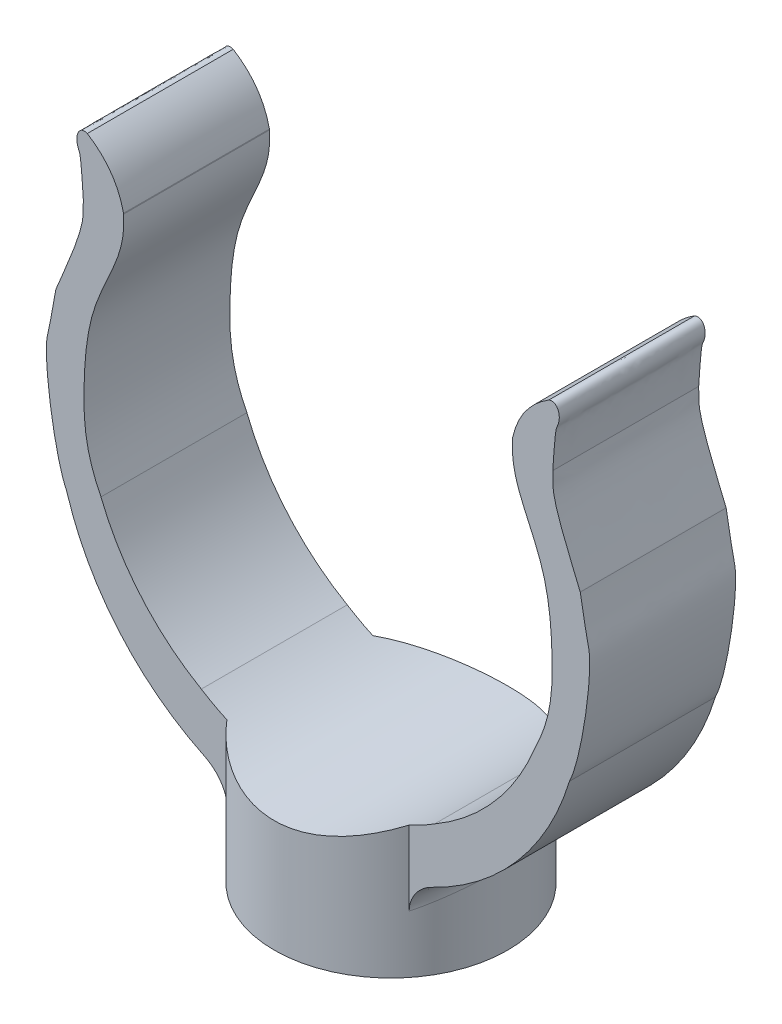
from build123d import *

# Parameters (mm, degrees)
BOSS_EXTRU_1_DEPTH      = 5
ESQUISSE2_W             = 8
ESQUISSE2_H             = 10
ENL_V_MAT_EXTRU_1_DEPTH = 10
CONG_2_R                = 2


with BuildPart() as part:
    # Esquisse1 → Boss.-Extru.1 (new, symmetric)
    with BuildSketch(Plane.XY):
        with BuildLine():
            Line((13.322060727, 27.670467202), (13.331601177, 27.719548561))
            add(Edge.make_bspline(
                [(13.331601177, 27.719548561), (13.827952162, 29.975991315), (15.815543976, 31.208467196)],
                knots=[0, 0, 0, 1, 1, 1], degree=2))
            add(Edge.make_bspline(
                [(16.088244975, 27.153165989), (16.091345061, 27.17556211), (16.227900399, 29.598287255), (16.44580055, 30.03221015), (16.667773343, 30.711579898), (16.276158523, 31.392474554), (15.815543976, 31.208467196)],
                knots=[0, 0, 0, 0, 0.319811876, 0.380234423, 0.604225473, 1, 1, 1, 1], degree=3))
            add(Edge.make_bspline(
                [(17.970441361, 20.884051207), (17.968154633, 20.898055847), (15.778116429, 26.01056167), (16.148061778, 26.238964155), (16.088244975, 27.153165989)],
                knots=[0.213455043, 0.213455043, 0.213455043, 0.213455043, 0.458677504, 1, 1, 1, 1], degree=3))
            add(Edge.make_bspline(
                [(17.970441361, 20.884051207), (18.289882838, 18.927691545), (18.536027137, 18.086463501), (18.769092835, 15.99102451), (18.004725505, 10.851542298), (17.225902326, 9.278095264)],
                knots=[0, 0, 0, 0, 0.210543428, 0.310543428, 1, 1, 1, 1], degree=3))
            ThreePointArc((17.225902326, 9.278095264), (0, -3.5), (-17.225902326, 9.278095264))
            add(Edge.make_bspline(
                [(-17.970441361, 20.884051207), (-18.289882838, 18.927691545), (-18.536027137, 18.086463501), (-18.769092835, 15.99102451), (-18.004725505, 10.851542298), (-17.225902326, 9.278095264)],
                knots=[0, 0, 0, 0, 0.210543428, 0.310543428, 1, 1, 1, 1], degree=3))
            add(Edge.make_bspline(
                [(-17.970441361, 20.884051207), (-17.968154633, 20.898055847), (-15.778116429, 26.01056167), (-16.148061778, 26.238964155), (-16.088244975, 27.153165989)],
                knots=[0.213455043, 0.213455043, 0.213455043, 0.213455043, 0.458677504, 1, 1, 1, 1], degree=3))
            add(Edge.make_bspline(
                [(-16.088244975, 27.153165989), (-16.091345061, 27.17556211), (-16.227900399, 29.598287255), (-16.44580055, 30.03221015), (-16.667773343, 30.711579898), (-16.276158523, 31.392474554), (-15.815543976, 31.208467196)],
                knots=[0, 0, 0, 0, 0.319811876, 0.380234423, 0.604225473, 1, 1, 1, 1], degree=3))
            add(Edge.make_bspline(
                [(-13.331601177, 27.719548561), (-13.827952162, 29.975991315), (-15.815543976, 31.208467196)],
                knots=[0, 0, 0, 1, 1, 1], degree=2))
            Line((-13.331601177, 27.719548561), (-13.322060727, 27.670467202))
            add(Edge.make_bspline(
                [(-13.322060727, 27.670467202), (-13.226052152, 26.138729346), (-14.007407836, 24.089269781), (-15.786848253, 20.474933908), (-16.185099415, 15.226605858), (-15.950986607, 12.242506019), (-14.876573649, 10.110385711)],
                knots=[0, 0, 0, 0, 0.203211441, 0.376639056, 0.640999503, 1, 1, 1, 1], degree=3))
            ThreePointArc((-14.876573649, 10.110385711), (0, 0), (14.876573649, 10.110385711))
            add(Edge.make_bspline(
                [(13.322060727, 27.670467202), (13.226052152, 26.138729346), (14.007407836, 24.089269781), (15.786848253, 20.474933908), (16.185099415, 15.226605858), (15.950986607, 12.242506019), (14.876573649, 10.110385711)],
                knots=[0, 0, 0, 0, 0.203211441, 0.376639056, 0.640999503, 1, 1, 1, 1], degree=3))
        make_face()
    extrude(amount=BOSS_EXTRU_1_DEPTH, both=True)

    # Esquisse2 → R_volution1 (revolve)
    with BuildSketch(Plane.XY, mode=Mode.PRIVATE) as r_volution1_sk:
        with Locations((4, -2.856406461)):
            Rectangle(ESQUISSE2_W, ESQUISSE2_H)
    revolve(r_volution1_sk.sketch.rotate(Axis((0, 2.143593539, 0), (0, -1, 0)), 180), axis=Axis((0, 2.143593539, 0), (0, -1, 0)))

    # Esquisse4 → Enl_v. mat.-Extru.1 (cut, symmetric)
    with BuildSketch(Plane.XY):
        with BuildLine():
            Line((8, 2.143593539), (-8, 2.143593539))
            ThreePointArc((-8, 2.143593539), (0, -0.16782892), (8, 2.143593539))
        make_face()
    extrude(amount=ENL_V_MAT_EXTRU_1_DEPTH, both=True, mode=Mode.SUBTRACT)

    # Cong_2
    cong_2_edges = [part.edges().sort_by_distance(p)[0] for p in [
        (-7.541432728, -1.844013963, 2.66960529),
        (8, -1.624515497, 0),
    ]]
    fillet(cong_2_edges, radius=CONG_2_R)


solid = part.part
